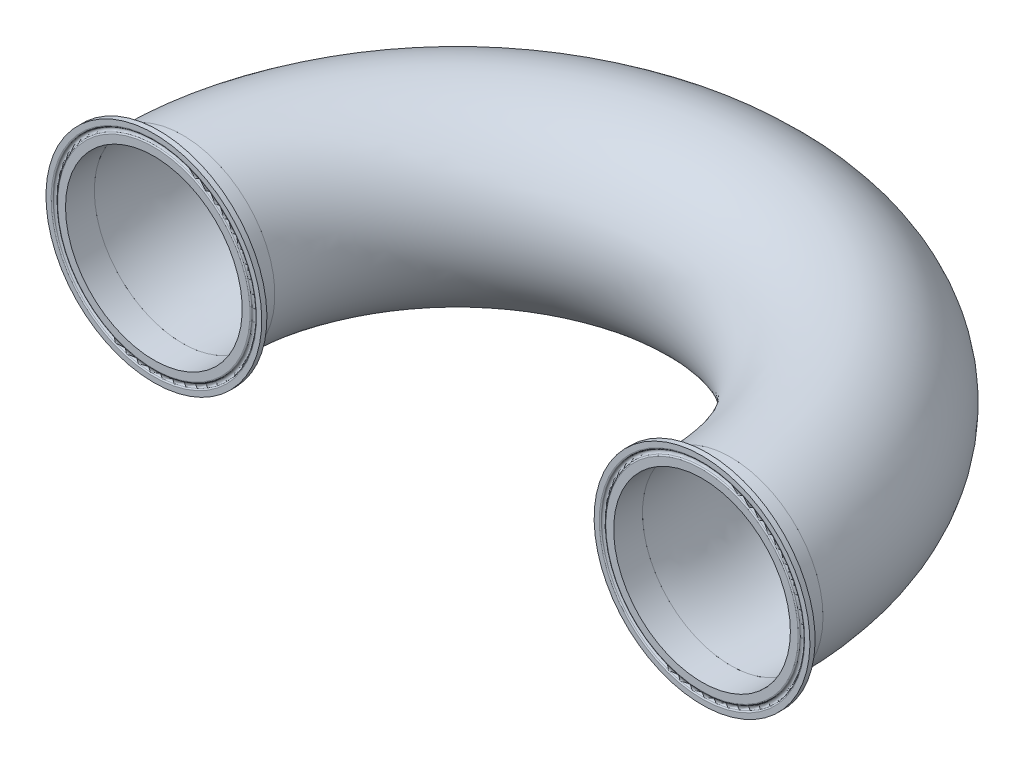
ISO-10303-21;
HEADER;
FILE_DESCRIPTION(('STEP AP214'),'2;1');
FILE_NAME('part.step','',(''),(''),'','','');
FILE_SCHEMA(('AUTOMOTIVE_DESIGN { 1 0 10303 214 1 1 1 1 }'));
ENDSEC;
DATA;
#1=APPLICATION_CONTEXT('core data for automotive mechanical design processes');
#2=APPLICATION_PROTOCOL_DEFINITION('international standard','automotive_design',2000,#1);
#3=PRODUCT_CONTEXT('',#1,'mechanical');
#4=PRODUCT('Part','Part','',(#3));
#5=PRODUCT_RELATED_PRODUCT_CATEGORY('part','',(#4));
#6=PRODUCT_DEFINITION_FORMATION('','',#4);
#7=PRODUCT_DEFINITION_CONTEXT('part definition',#1,'design');
#8=PRODUCT_DEFINITION('design','',#6,#7);
#9=PRODUCT_DEFINITION_SHAPE('','',#8);
#10=(LENGTH_UNIT() NAMED_UNIT(*) SI_UNIT(.MILLI.,.METRE.));
#11=(NAMED_UNIT(*) PLANE_ANGLE_UNIT() SI_UNIT($,.RADIAN.));
#12=(NAMED_UNIT(*) SI_UNIT($,.STERADIAN.) SOLID_ANGLE_UNIT());
#13=UNCERTAINTY_MEASURE_WITH_UNIT(LENGTH_MEASURE(1.E-05),#10,'distance_accuracy_value','');
#14=(GEOMETRIC_REPRESENTATION_CONTEXT(3) GLOBAL_UNCERTAINTY_ASSIGNED_CONTEXT((#13)) GLOBAL_UNIT_ASSIGNED_CONTEXT((#10,
#11,#12)) REPRESENTATION_CONTEXT('',''));
#15=CARTESIAN_POINT('',(0.,0.,0.));
#16=DIRECTION('',(0.,0.,1.));
#17=DIRECTION('',(1.,0.,0.));
#18=AXIS2_PLACEMENT_3D('',#15,#16,#17);
#19=CARTESIAN_POINT('',(271.905177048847,167.407690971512,294.905934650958));
#20=DIRECTION('',(0.,0.,1.));
#21=DIRECTION('',(0.930962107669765,-0.365115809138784,0.));
#22=AXIS2_PLACEMENT_3D('',#19,#20,#21);
#23=TOROIDAL_SURFACE('',#22,56.6185084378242,0.787400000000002);
#24=CARTESIAN_POINT('',(271.905177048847,167.407690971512,295.693334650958));
#25=DIRECTION('',(0.,0.,1.));
#26=DIRECTION('',(0.930962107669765,-0.365115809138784,0.));
#27=AXIS2_PLACEMENT_3D('',#24,#25,#26);
#28=CIRCLE('',#27,56.6185084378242);
#29=CARTESIAN_POINT('',(324.614862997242,146.735378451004,295.693334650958));
#30=VERTEX_POINT('',#29);
#31=EDGE_CURVE('P0_E48',#30,#30,#28,.T.);
#32=ORIENTED_EDGE('',*,*,#31,.T.);
#33=EDGE_LOOP('',(#32));
#34=FACE_BOUND('',#33,.T.);
#35=CARTESIAN_POINT('',(271.905177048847,167.407690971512,295.218875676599));
#36=DIRECTION('',(0.,0.,1.));
#37=DIRECTION('',(0.930962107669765,-0.365115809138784,0.));
#38=AXIS2_PLACEMENT_3D('',#35,#36,#37);
#39=CIRCLE('',#38,55.8959666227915);
#40=CARTESIAN_POINT('',(323.94220394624,146.999189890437,295.218875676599));
#41=VERTEX_POINT('',#40);
#42=EDGE_CURVE('P0_E9',#41,#41,#39,.T.);
#43=ORIENTED_EDGE('',*,*,#42,.F.);
#44=EDGE_LOOP('',(#43));
#45=FACE_BOUND('',#44,.T.);
#46=ADVANCED_FACE('P0_F14',(#34,#45),#23,.T.);
#47=CARTESIAN_POINT('',(271.905177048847,167.407690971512,295.693334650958));
#48=DIRECTION('',(0.,0.,1.));
#49=DIRECTION('',(0.930962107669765,-0.365115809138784,0.));
#50=AXIS2_PLACEMENT_3D('',#47,#48,#49);
#51=TOROIDAL_SURFACE('',#50,54.8005,1.1938);
#52=CARTESIAN_POINT('',(271.905177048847,167.407690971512,295.218875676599));
#53=DIRECTION('',(0.,0.,1.));
#54=DIRECTION('',(0.930962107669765,-0.365115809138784,0.));
#55=AXIS2_PLACEMENT_3D('',#52,#53,#54);
#56=CIRCLE('',#55,53.7050333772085);
#57=CARTESIAN_POINT('',(321.902528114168,147.799134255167,295.218875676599));
#58=VERTEX_POINT('',#57);
#59=EDGE_CURVE('P0_E20',#58,#58,#56,.T.);
#60=ORIENTED_EDGE('',*,*,#59,.F.);
#61=EDGE_LOOP('',(#60));
#62=FACE_BOUND('',#61,.T.);
#63=ORIENTED_EDGE('',*,*,#42,.T.);
#64=EDGE_LOOP('',(#63));
#65=FACE_BOUND('',#64,.T.);
#66=ADVANCED_FACE('P0_F97',(#62,#65),#51,.F.);
#67=CARTESIAN_POINT('',(271.905177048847,167.407690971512,294.905934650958));
#68=DIRECTION('',(0.,0.,1.));
#69=DIRECTION('',(0.930962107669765,-0.365115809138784,0.));
#70=AXIS2_PLACEMENT_3D('',#67,#68,#69);
#71=TOROIDAL_SURFACE('',#70,52.9824915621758,0.787399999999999);
#72=ORIENTED_EDGE('',*,*,#59,.T.);
#73=EDGE_LOOP('',(#72));
#74=FACE_BOUND('',#73,.T.);
#75=CARTESIAN_POINT('',(271.905177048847,167.407690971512,295.693334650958));
#76=DIRECTION('',(0.,0.,1.));
#77=DIRECTION('',(0.930962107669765,-0.365115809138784,0.));
#78=AXIS2_PLACEMENT_3D('',#75,#76,#77);
#79=CIRCLE('',#78,52.9824915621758);
#80=CARTESIAN_POINT('',(321.229869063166,148.062945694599,295.693334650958));
#81=VERTEX_POINT('',#80);
#82=EDGE_CURVE('P0_E24',#81,#81,#79,.T.);
#83=ORIENTED_EDGE('',*,*,#82,.F.);
#84=EDGE_LOOP('',(#83));
#85=FACE_BOUND('',#84,.T.);
#86=ADVANCED_FACE('P0_F93',(#74,#85),#71,.T.);
#87=CARTESIAN_POINT('',(271.905177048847,167.407690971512,295.693334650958));
#88=DIRECTION('',(0.,0.,-1.));
#89=DIRECTION('',(-0.930962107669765,0.365115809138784,0.));
#90=AXIS2_PLACEMENT_3D('',#87,#88,#89);
#91=PLANE('',#90);
#92=CARTESIAN_POINT('',(271.905177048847,167.407690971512,295.693334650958));
#93=DIRECTION('',(0.,0.,1.));
#94=DIRECTION('',(0.930962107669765,-0.365115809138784,0.));
#95=AXIS2_PLACEMENT_3D('',#92,#93,#94);
#96=CIRCLE('',#95,48.6918);
#97=CARTESIAN_POINT('',(317.235397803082,149.629545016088,295.693334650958));
#98=VERTEX_POINT('',#97);
#99=EDGE_CURVE('P0_E28',#98,#98,#96,.T.);
#100=ORIENTED_EDGE('',*,*,#99,.F.);
#101=EDGE_LOOP('',(#100));
#102=FACE_BOUND('',#101,.T.);
#103=ORIENTED_EDGE('',*,*,#82,.T.);
#104=EDGE_LOOP('',(#103));
#105=FACE_BOUND('',#104,.T.);
#106=ADVANCED_FACE('P0_F86',(#102,#105),#91,.F.);
#107=CARTESIAN_POINT('',(271.905177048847,167.407690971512,295.693334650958));
#108=DIRECTION('',(0.,0.,1.));
#109=DIRECTION('',(0.930962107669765,-0.365115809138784,0.));
#110=AXIS2_PLACEMENT_3D('',#107,#108,#109);
#111=CYLINDRICAL_SURFACE('',#110,48.6918);
#112=ORIENTED_EDGE('',*,*,#99,.T.);
#113=EDGE_LOOP('',(#112));
#114=FACE_BOUND('',#113,.T.);
#115=CARTESIAN_POINT('',(271.905177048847,167.407690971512,279.818334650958));
#116=DIRECTION('',(0.,0.,1.));
#117=DIRECTION('',(0.930962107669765,-0.365115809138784,0.));
#118=AXIS2_PLACEMENT_3D('',#115,#116,#117);
#119=CIRCLE('',#118,48.6918);
#120=CARTESIAN_POINT('',(317.235397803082,149.629545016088,279.818334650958));
#121=VERTEX_POINT('',#120);
#122=EDGE_CURVE('P0_E33',#121,#121,#119,.T.);
#123=ORIENTED_EDGE('',*,*,#122,.F.);
#124=EDGE_LOOP('',(#123));
#125=FACE_BOUND('',#124,.T.);
#126=ADVANCED_FACE('P0_F81',(#114,#125),#111,.F.);
#127=CARTESIAN_POINT('',(271.905177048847,167.407690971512,279.818334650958));
#128=DIRECTION('',(0.,0.,1.));
#129=DIRECTION('',(0.930962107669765,-0.365115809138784,0.));
#130=AXIS2_PLACEMENT_3D('',#127,#128,#129);
#131=PLANE('',#130);
#132=CARTESIAN_POINT('',(271.905177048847,167.407690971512,279.818334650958));
#133=DIRECTION('',(0.,0.,1.));
#134=DIRECTION('',(0.930962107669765,-0.365115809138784,0.));
#135=AXIS2_PLACEMENT_3D('',#132,#133,#134);
#136=CIRCLE('',#135,50.8);
#137=CARTESIAN_POINT('',(319.198052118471,148.859807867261,279.818334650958));
#138=VERTEX_POINT('',#137);
#139=EDGE_CURVE('P0_E36',#138,#138,#136,.T.);
#140=ORIENTED_EDGE('',*,*,#139,.F.);
#141=EDGE_LOOP('',(#140));
#142=FACE_BOUND('',#141,.T.);
#143=ORIENTED_EDGE('',*,*,#122,.T.);
#144=EDGE_LOOP('',(#143));
#145=FACE_BOUND('',#144,.T.);
#146=ADVANCED_FACE('P0_F75',(#142,#145),#131,.F.);
#147=CARTESIAN_POINT('',(271.905177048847,167.407690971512,295.693334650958));
#148=DIRECTION('',(0.,0.,1.));
#149=DIRECTION('',(0.930962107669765,-0.365115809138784,0.));
#150=AXIS2_PLACEMENT_3D('',#147,#148,#149);
#151=CYLINDRICAL_SURFACE('',#150,50.8);
#152=CARTESIAN_POINT('',(271.905177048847,167.407690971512,289.696042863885));
#153=DIRECTION('',(0.,0.,1.));
#154=DIRECTION('',(0.930962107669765,-0.365115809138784,0.));
#155=AXIS2_PLACEMENT_3D('',#152,#153,#154);
#156=CIRCLE('',#155,50.8);
#157=CARTESIAN_POINT('',(319.198052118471,148.859807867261,289.696042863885));
#158=VERTEX_POINT('',#157);
#159=EDGE_CURVE('P0_E39',#158,#158,#156,.T.);
#160=ORIENTED_EDGE('',*,*,#159,.F.);
#161=EDGE_LOOP('',(#160));
#162=FACE_BOUND('',#161,.T.);
#163=ORIENTED_EDGE('',*,*,#139,.T.);
#164=EDGE_LOOP('',(#163));
#165=FACE_BOUND('',#164,.T.);
#166=ADVANCED_FACE('P0_F69',(#162,#165),#151,.T.);
#167=CARTESIAN_POINT('',(271.905177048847,167.407690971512,289.696042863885));
#168=DIRECTION('',(0.,0.,1.));
#169=DIRECTION('',(0.930962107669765,-0.365115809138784,0.));
#170=AXIS2_PLACEMENT_3D('',#167,#168,#169);
#171=CONICAL_SURFACE('',#170,50.8,1.22173047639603);
#172=CARTESIAN_POINT('',(271.905177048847,167.407690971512,292.848534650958));
#173=DIRECTION('',(0.,0.,1.));
#174=DIRECTION('',(0.930962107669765,-0.365115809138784,0.));
#175=AXIS2_PLACEMENT_3D('',#172,#173,#174);
#176=CIRCLE('',#175,59.4614);
#177=CARTESIAN_POINT('',(327.261487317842,145.697393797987,292.848534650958));
#178=VERTEX_POINT('',#177);
#179=EDGE_CURVE('P0_E42',#178,#178,#176,.T.);
#180=ORIENTED_EDGE('',*,*,#179,.F.);
#181=EDGE_LOOP('',(#180));
#182=FACE_BOUND('',#181,.T.);
#183=ORIENTED_EDGE('',*,*,#159,.T.);
#184=EDGE_LOOP('',(#183));
#185=FACE_BOUND('',#184,.T.);
#186=ADVANCED_FACE('P0_F63',(#182,#185),#171,.T.);
#187=CARTESIAN_POINT('',(271.905177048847,167.407690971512,295.693334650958));
#188=DIRECTION('',(0.,0.,1.));
#189=DIRECTION('',(0.930962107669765,-0.365115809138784,0.));
#190=AXIS2_PLACEMENT_3D('',#187,#188,#189);
#191=CYLINDRICAL_SURFACE('',#190,59.4614);
#192=CARTESIAN_POINT('',(271.905177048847,167.407690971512,295.693334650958));
#193=DIRECTION('',(0.,0.,1.));
#194=DIRECTION('',(0.930962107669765,-0.365115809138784,0.));
#195=AXIS2_PLACEMENT_3D('',#192,#193,#194);
#196=CIRCLE('',#195,59.4614);
#197=CARTESIAN_POINT('',(327.261487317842,145.697393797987,295.693334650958));
#198=VERTEX_POINT('',#197);
#199=EDGE_CURVE('P0_E45',#198,#198,#196,.T.);
#200=ORIENTED_EDGE('',*,*,#199,.F.);
#201=EDGE_LOOP('',(#200));
#202=FACE_BOUND('',#201,.T.);
#203=ORIENTED_EDGE('',*,*,#179,.T.);
#204=EDGE_LOOP('',(#203));
#205=FACE_BOUND('',#204,.T.);
#206=ADVANCED_FACE('P0_F57',(#202,#205),#191,.T.);
#207=CARTESIAN_POINT('',(271.905177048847,167.407690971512,295.693334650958));
#208=DIRECTION('',(0.,0.,-1.));
#209=DIRECTION('',(-0.930962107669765,0.365115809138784,0.));
#210=AXIS2_PLACEMENT_3D('',#207,#208,#209);
#211=PLANE('',#210);
#212=ORIENTED_EDGE('',*,*,#31,.F.);
#213=EDGE_LOOP('',(#212));
#214=FACE_BOUND('',#213,.T.);
#215=ORIENTED_EDGE('',*,*,#199,.T.);
#216=EDGE_LOOP('',(#215));
#217=FACE_BOUND('',#216,.T.);
#218=ADVANCED_FACE('P0_F54',(#214,#217),#211,.F.);
#219=CLOSED_SHELL('',(#46,#66,#86,#106,#126,#146,#166,#186,#206,#218));
#220=MANIFOLD_SOLID_BREP('P0_B1',#219);
#221=CARTESIAN_POINT('',(-32.8826122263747,167.407690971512,292.177655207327));
#222=DIRECTION('',(0.,0.,1.));
#223=DIRECTION('',(0.90950742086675,-0.415687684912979,0.));
#224=AXIS2_PLACEMENT_3D('',#221,#222,#223);
#225=TOROIDAL_SURFACE('',#224,56.6185084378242,0.787400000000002);
#226=CARTESIAN_POINT('',(-32.8826122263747,167.407690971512,292.965055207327));
#227=DIRECTION('',(0.,0.,1.));
#228=DIRECTION('',(0.90950742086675,-0.415687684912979,0.));
#229=AXIS2_PLACEMENT_3D('',#226,#227,#228);
#230=CIRCLE('',#229,56.6185084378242);
#231=CARTESIAN_POINT('',(18.6123413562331,143.872074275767,292.965055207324));
#232=VERTEX_POINT('',#231);
#233=EDGE_CURVE('P1_E49',#232,#232,#230,.T.);
#234=ORIENTED_EDGE('',*,*,#233,.T.);
#235=EDGE_LOOP('',(#234));
#236=FACE_BOUND('',#235,.T.);
#237=CARTESIAN_POINT('',(-32.8826122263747,167.407690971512,292.490596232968));
#238=DIRECTION('',(0.,0.,1.));
#239=DIRECTION('',(0.90950742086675,-0.415687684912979,0.));
#240=AXIS2_PLACEMENT_3D('',#237,#238,#239);
#241=CIRCLE('',#240,55.8959666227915);
#242=CARTESIAN_POINT('',(17.9551842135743,144.17242601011,292.490596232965));
#243=VERTEX_POINT('',#242);
#244=EDGE_CURVE('P1_E10',#243,#243,#241,.T.);
#245=ORIENTED_EDGE('',*,*,#244,.F.);
#246=EDGE_LOOP('',(#245));
#247=FACE_BOUND('',#246,.T.);
#248=ADVANCED_FACE('P1_F15',(#236,#247),#225,.T.);
#249=CARTESIAN_POINT('',(-32.8826122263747,167.407690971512,292.965055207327));
#250=DIRECTION('',(0.,0.,1.));
#251=DIRECTION('',(0.90950742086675,-0.415687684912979,0.));
#252=AXIS2_PLACEMENT_3D('',#249,#250,#251);
#253=TOROIDAL_SURFACE('',#252,54.8005,1.1938);
#254=CARTESIAN_POINT('',(-32.8826122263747,167.407690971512,292.490596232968));
#255=DIRECTION('',(0.,0.,1.));
#256=DIRECTION('',(0.90950742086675,-0.415687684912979,0.));
#257=AXIS2_PLACEMENT_3D('',#254,#255,#256);
#258=CIRCLE('',#257,53.7050333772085);
#259=CARTESIAN_POINT('',(15.9625141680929,145.083169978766,292.490596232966));
#260=VERTEX_POINT('',#259);
#261=EDGE_CURVE('P1_E21',#260,#260,#258,.T.);
#262=ORIENTED_EDGE('',*,*,#261,.F.);
#263=EDGE_LOOP('',(#262));
#264=FACE_BOUND('',#263,.T.);
#265=ORIENTED_EDGE('',*,*,#244,.T.);
#266=EDGE_LOOP('',(#265));
#267=FACE_BOUND('',#266,.T.);
#268=ADVANCED_FACE('P1_F98',(#264,#267),#253,.F.);
#269=CARTESIAN_POINT('',(-32.8826122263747,167.407690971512,292.177655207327));
#270=DIRECTION('',(0.,0.,1.));
#271=DIRECTION('',(0.90950742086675,-0.415687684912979,0.));
#272=AXIS2_PLACEMENT_3D('',#269,#270,#271);
#273=TOROIDAL_SURFACE('',#272,52.9824915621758,0.787399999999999);
#274=ORIENTED_EDGE('',*,*,#261,.T.);
#275=EDGE_LOOP('',(#274));
#276=FACE_BOUND('',#275,.T.);
#277=CARTESIAN_POINT('',(-32.8826122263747,167.407690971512,292.965055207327));
#278=DIRECTION('',(0.,0.,1.));
#279=DIRECTION('',(0.90950742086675,-0.415687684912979,0.));
#280=AXIS2_PLACEMENT_3D('',#277,#278,#279);
#281=CIRCLE('',#280,52.9824915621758);
#282=CARTESIAN_POINT('',(15.3053570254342,145.383521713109,292.965055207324));
#283=VERTEX_POINT('',#282);
#284=EDGE_CURVE('P1_E25',#283,#283,#281,.T.);
#285=ORIENTED_EDGE('',*,*,#284,.F.);
#286=EDGE_LOOP('',(#285));
#287=FACE_BOUND('',#286,.T.);
#288=ADVANCED_FACE('P1_F94',(#276,#287),#273,.T.);
#289=CARTESIAN_POINT('',(-32.8826122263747,167.407690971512,292.965055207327));
#290=DIRECTION('',(0.,0.,-1.));
#291=DIRECTION('',(-0.90950742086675,0.415687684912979,0.));
#292=AXIS2_PLACEMENT_3D('',#289,#290,#291);
#293=PLANE('',#292);
#294=CARTESIAN_POINT('',(-32.8826122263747,167.407690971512,292.965055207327));
#295=DIRECTION('',(0.,0.,1.));
#296=DIRECTION('',(0.90950742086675,-0.415687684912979,0.));
#297=AXIS2_PLACEMENT_3D('',#294,#295,#296);
#298=CIRCLE('',#297,48.6918);
#299=CARTESIAN_POINT('',(11.4029412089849,147.167109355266,292.965055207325));
#300=VERTEX_POINT('',#299);
#301=EDGE_CURVE('P1_E29',#300,#300,#298,.T.);
#302=ORIENTED_EDGE('',*,*,#301,.F.);
#303=EDGE_LOOP('',(#302));
#304=FACE_BOUND('',#303,.T.);
#305=ORIENTED_EDGE('',*,*,#284,.T.);
#306=EDGE_LOOP('',(#305));
#307=FACE_BOUND('',#306,.T.);
#308=ADVANCED_FACE('P1_F87',(#304,#307),#293,.F.);
#309=CARTESIAN_POINT('',(-32.8826122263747,167.407690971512,292.965055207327));
#310=DIRECTION('',(0.,0.,1.));
#311=DIRECTION('',(0.90950742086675,-0.415687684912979,0.));
#312=AXIS2_PLACEMENT_3D('',#309,#310,#311);
#313=CYLINDRICAL_SURFACE('',#312,48.6918);
#314=ORIENTED_EDGE('',*,*,#301,.T.);
#315=EDGE_LOOP('',(#314));
#316=FACE_BOUND('',#315,.T.);
#317=CARTESIAN_POINT('',(-32.8826122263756,167.407690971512,277.090055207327));
#318=DIRECTION('',(0.,0.,1.));
#319=DIRECTION('',(0.90950742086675,-0.415687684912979,0.));
#320=AXIS2_PLACEMENT_3D('',#317,#318,#319);
#321=CIRCLE('',#320,48.6918);
#322=CARTESIAN_POINT('',(11.402941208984,147.167109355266,277.090055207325));
#323=VERTEX_POINT('',#322);
#324=EDGE_CURVE('P1_E34',#323,#323,#321,.T.);
#325=ORIENTED_EDGE('',*,*,#324,.F.);
#326=EDGE_LOOP('',(#325));
#327=FACE_BOUND('',#326,.T.);
#328=ADVANCED_FACE('P1_F82',(#316,#327),#313,.F.);
#329=CARTESIAN_POINT('',(-32.8826122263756,167.407690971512,277.090055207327));
#330=DIRECTION('',(0.,0.,1.));
#331=DIRECTION('',(0.90950742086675,-0.415687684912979,0.));
#332=AXIS2_PLACEMENT_3D('',#329,#330,#331);
#333=PLANE('',#332);
#334=CARTESIAN_POINT('',(-32.8826122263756,167.407690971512,277.090055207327));
#335=DIRECTION('',(0.,0.,1.));
#336=DIRECTION('',(0.90950742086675,-0.415687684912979,0.));
#337=AXIS2_PLACEMENT_3D('',#334,#335,#336);
#338=CIRCLE('',#337,50.8);
#339=CARTESIAN_POINT('',(13.3203647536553,146.290756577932,277.090055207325));
#340=VERTEX_POINT('',#339);
#341=EDGE_CURVE('P1_E37',#340,#340,#338,.T.);
#342=ORIENTED_EDGE('',*,*,#341,.F.);
#343=EDGE_LOOP('',(#342));
#344=FACE_BOUND('',#343,.T.);
#345=ORIENTED_EDGE('',*,*,#324,.T.);
#346=EDGE_LOOP('',(#345));
#347=FACE_BOUND('',#346,.T.);
#348=ADVANCED_FACE('P1_F76',(#344,#347),#333,.F.);
#349=CARTESIAN_POINT('',(-32.8826122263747,167.407690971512,292.965055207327));
#350=DIRECTION('',(0.,0.,1.));
#351=DIRECTION('',(0.90950742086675,-0.415687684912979,0.));
#352=AXIS2_PLACEMENT_3D('',#349,#350,#351);
#353=CYLINDRICAL_SURFACE('',#352,50.8);
#354=CARTESIAN_POINT('',(-32.882612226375,167.407690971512,286.967763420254));
#355=DIRECTION('',(0.,0.,1.));
#356=DIRECTION('',(0.90950742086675,-0.415687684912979,0.));
#357=AXIS2_PLACEMENT_3D('',#354,#355,#356);
#358=CIRCLE('',#357,50.8);
#359=CARTESIAN_POINT('',(13.3203647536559,146.290756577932,286.967763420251));
#360=VERTEX_POINT('',#359);
#361=EDGE_CURVE('P1_E40',#360,#360,#358,.T.);
#362=ORIENTED_EDGE('',*,*,#361,.F.);
#363=EDGE_LOOP('',(#362));
#364=FACE_BOUND('',#363,.T.);
#365=ORIENTED_EDGE('',*,*,#341,.T.);
#366=EDGE_LOOP('',(#365));
#367=FACE_BOUND('',#366,.T.);
#368=ADVANCED_FACE('P1_F70',(#364,#367),#353,.T.);
#369=CARTESIAN_POINT('',(-32.882612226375,167.407690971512,286.967763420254));
#370=DIRECTION('',(0.,0.,1.));
#371=DIRECTION('',(0.90950742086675,-0.415687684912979,0.));
#372=AXIS2_PLACEMENT_3D('',#369,#370,#371);
#373=CONICAL_SURFACE('',#372,50.8,1.22173047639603);
#374=CARTESIAN_POINT('',(-32.8826122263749,167.407690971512,290.120255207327));
#375=DIRECTION('',(0.,0.,1.));
#376=DIRECTION('',(0.90950742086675,-0.415687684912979,0.));
#377=AXIS2_PLACEMENT_3D('',#374,#375,#376);
#378=CIRCLE('',#377,59.4614);
#379=CARTESIAN_POINT('',(21.1979723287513,142.690319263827,290.120255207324));
#380=VERTEX_POINT('',#379);
#381=EDGE_CURVE('P1_E43',#380,#380,#378,.T.);
#382=ORIENTED_EDGE('',*,*,#381,.F.);
#383=EDGE_LOOP('',(#382));
#384=FACE_BOUND('',#383,.T.);
#385=ORIENTED_EDGE('',*,*,#361,.T.);
#386=EDGE_LOOP('',(#385));
#387=FACE_BOUND('',#386,.T.);
#388=ADVANCED_FACE('P1_F64',(#384,#387),#373,.T.);
#389=CARTESIAN_POINT('',(-32.8826122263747,167.407690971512,292.965055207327));
#390=DIRECTION('',(0.,0.,1.));
#391=DIRECTION('',(0.90950742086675,-0.415687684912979,0.));
#392=AXIS2_PLACEMENT_3D('',#389,#390,#391);
#393=CYLINDRICAL_SURFACE('',#392,59.4614);
#394=CARTESIAN_POINT('',(-32.8826122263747,167.407690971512,292.965055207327));
#395=DIRECTION('',(0.,0.,1.));
#396=DIRECTION('',(0.90950742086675,-0.415687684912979,0.));
#397=AXIS2_PLACEMENT_3D('',#394,#395,#396);
#398=CIRCLE('',#397,59.4614);
#399=CARTESIAN_POINT('',(21.1979723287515,142.690319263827,292.965055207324));
#400=VERTEX_POINT('',#399);
#401=EDGE_CURVE('P1_E46',#400,#400,#398,.T.);
#402=ORIENTED_EDGE('',*,*,#401,.F.);
#403=EDGE_LOOP('',(#402));
#404=FACE_BOUND('',#403,.T.);
#405=ORIENTED_EDGE('',*,*,#381,.T.);
#406=EDGE_LOOP('',(#405));
#407=FACE_BOUND('',#406,.T.);
#408=ADVANCED_FACE('P1_F58',(#404,#407),#393,.T.);
#409=CARTESIAN_POINT('',(-32.8826122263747,167.407690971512,292.965055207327));
#410=DIRECTION('',(0.,0.,-1.));
#411=DIRECTION('',(-0.90950742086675,0.415687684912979,0.));
#412=AXIS2_PLACEMENT_3D('',#409,#410,#411);
#413=PLANE('',#412);
#414=ORIENTED_EDGE('',*,*,#233,.F.);
#415=EDGE_LOOP('',(#414));
#416=FACE_BOUND('',#415,.T.);
#417=ORIENTED_EDGE('',*,*,#401,.T.);
#418=EDGE_LOOP('',(#417));
#419=FACE_BOUND('',#418,.T.);
#420=ADVANCED_FACE('P1_F55',(#416,#419),#413,.F.);
#421=CLOSED_SHELL('',(#248,#268,#288,#308,#328,#348,#368,#388,#408,#420));
#422=MANIFOLD_SOLID_BREP('P1_B1',#421);
#423=CARTESIAN_POINT('',(-32.8826122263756,167.407690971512,277.090055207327));
#424=DIRECTION('',(0.,0.,-1.));
#425=DIRECTION('',(-1.,0.,0.));
#426=AXIS2_PLACEMENT_3D('',#423,#424,#425);
#427=CIRCLE('',#426,50.8);
#428=CARTESIAN_POINT('',(119.511282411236,167.407690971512,278.454194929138));
#429=DIRECTION('',(0.,-1.,0.));
#430=AXIS1_PLACEMENT('',#428,#429);
#431=SURFACE_OF_REVOLUTION('',#427,#430);
#432=CARTESIAN_POINT('',(-83.6826122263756,167.407690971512,277.09005520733));
#433=VERTEX_POINT('',#432);
#434=EDGE_CURVE('P2_E10',#433,#433,#427,.T.);
#435=ORIENTED_EDGE('',*,*,#434,.T.);
#436=EDGE_LOOP('',(#435));
#437=FACE_BOUND('',#436,.T.);
#438=CARTESIAN_POINT('',(271.905177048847,167.407690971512,279.818334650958));
#439=DIRECTION('',(0.,0.,1.));
#440=DIRECTION('',(1.,0.,0.));
#441=AXIS2_PLACEMENT_3D('',#438,#439,#440);
#442=CIRCLE('',#441,50.8);
#443=CARTESIAN_POINT('',(322.705177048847,167.407690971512,279.818334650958));
#444=VERTEX_POINT('',#443);
#445=EDGE_CURVE('P2_E22',#444,#444,#442,.T.);
#446=ORIENTED_EDGE('',*,*,#445,.F.);
#447=EDGE_LOOP('',(#446));
#448=FACE_BOUND('',#447,.T.);
#449=ADVANCED_FACE('P2_F15',(#437,#448),#431,.F.);
#450=CARTESIAN_POINT('',(-32.8826122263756,167.407690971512,277.090055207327));
#451=DIRECTION('',(0.,0.,-1.));
#452=DIRECTION('',(-1.,0.,0.));
#453=AXIS2_PLACEMENT_3D('',#450,#451,#452);
#454=PLANE('',#453);
#455=CARTESIAN_POINT('',(15.8090015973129,167.407690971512,277.090055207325));
#456=CARTESIAN_POINT('',(15.8089925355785,166.03991684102,277.090055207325));
#457=CARTESIAN_POINT('',(15.7513206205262,164.671880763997,277.090055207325));
#458=CARTESIAN_POINT('',(15.5209904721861,161.945301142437,277.090055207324));
#459=CARTESIAN_POINT('',(15.3483019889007,160.58676019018,277.090055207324));
#460=CARTESIAN_POINT('',(14.8888907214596,157.887510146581,277.090055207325));
#461=CARTESIAN_POINT('',(14.6020418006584,156.546822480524,277.090055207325));
#462=CARTESIAN_POINT('',(13.9163735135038,153.894497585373,277.090055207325));
#463=CARTESIAN_POINT('',(13.5175615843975,152.582858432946,277.090055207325));
#464=CARTESIAN_POINT('',(12.6110039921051,149.998446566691,277.090055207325));
#465=CARTESIAN_POINT('',(12.103307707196,148.72565653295,277.090055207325));
#466=CARTESIAN_POINT('',(10.982475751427,146.227357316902,277.090055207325));
#467=CARTESIAN_POINT('',(10.3693384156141,145.001848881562,277.090055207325));
#468=CARTESIAN_POINT('',(9.04215943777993,142.607154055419,277.090055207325));
#469=CARTESIAN_POINT('',(8.3281435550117,141.437953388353,277.090055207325));
#470=CARTESIAN_POINT('',(6.8041675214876,139.163855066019,277.090055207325));
#471=CARTESIAN_POINT('',(5.99420774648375,138.058957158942,277.090055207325));
#472=CARTESIAN_POINT('',(4.2840114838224,135.92120402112,277.090055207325));
#473=CARTESIAN_POINT('',(3.38376582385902,134.888356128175,277.090055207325));
#474=CARTESIAN_POINT('',(1.49946544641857,132.902168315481,277.090055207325));
#475=CARTESIAN_POINT('',(0.515410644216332,131.948828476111,277.090055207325));
#476=CARTESIAN_POINT('',(-1.52955131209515,130.128400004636,277.090055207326));
#477=CARTESIAN_POINT('',(-2.59046145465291,129.261314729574,277.090055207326));
#478=CARTESIAN_POINT('',(-4.78155724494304,127.619602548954,277.090055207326));
#479=CARTESIAN_POINT('',(-5.91174287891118,126.844975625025,277.090055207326));
#480=CARTESIAN_POINT('',(-8.23332684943,125.393704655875,277.090055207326));
#481=CARTESIAN_POINT('',(-9.42472372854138,124.717058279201,277.090055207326));
#482=CARTESIAN_POINT('',(-11.8602847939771,123.466537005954,277.090055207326));
#483=CARTESIAN_POINT('',(-13.1044489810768,122.892662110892,277.090055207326));
#484=CARTESIAN_POINT('',(-15.6366967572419,121.851764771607,277.090055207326));
#485=CARTESIAN_POINT('',(-16.9247802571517,121.38474211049,277.090055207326));
#486=CARTESIAN_POINT('',(-19.535711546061,120.560867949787,277.090055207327));
#487=CARTESIAN_POINT('',(-20.8585593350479,120.20401645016,277.090055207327));
#488=CARTESIAN_POINT('',(-23.5296162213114,119.603021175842,277.090055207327));
#489=CARTESIAN_POINT('',(-24.8778253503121,119.358877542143,277.090055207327));
#490=CARTESIAN_POINT('',(-27.5900183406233,118.985034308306,277.090055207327));
#491=CARTESIAN_POINT('',(-28.954002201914,118.855334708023,277.090055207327));
#492=CARTESIAN_POINT('',(-31.688045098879,118.711301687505,277.090055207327));
#493=CARTESIAN_POINT('',(-33.0581041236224,118.696968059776,277.090055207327));
#494=CARTESIAN_POINT('',(-35.7945595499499,118.783768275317,277.090055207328));
#495=CARTESIAN_POINT('',(-37.1609559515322,118.884902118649,277.090055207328));
#496=CARTESIAN_POINT('',(-39.8803750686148,119.201918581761,277.090055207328));
#497=CARTESIAN_POINT('',(-41.2333977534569,119.41780146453,277.090055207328));
#498=CARTESIAN_POINT('',(-43.9164471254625,119.962781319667,277.090055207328));
#499=CARTESIAN_POINT('',(-45.2464738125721,120.291878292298,277.090055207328));
#500=CARTESIAN_POINT('',(-47.874076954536,121.060947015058,277.090055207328));
#501=CARTESIAN_POINT('',(-49.1716533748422,121.500918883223,277.090055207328));
#502=CARTESIAN_POINT('',(-51.725129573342,122.488609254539,277.090055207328));
#503=CARTESIAN_POINT('',(-52.9810293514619,123.03632775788,277.090055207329));
#504=CARTESIAN_POINT('',(-55.4422257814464,124.235618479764,277.090055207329));
#505=CARTESIAN_POINT('',(-56.6475223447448,124.887190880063,277.090055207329));
#506=CARTESIAN_POINT('',(-58.9989411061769,126.289556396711,277.090055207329));
#507=CARTESIAN_POINT('',(-60.145063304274,127.040349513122,277.090055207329));
#508=CARTESIAN_POINT('',(-62.3699846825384,128.635818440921,277.090055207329));
#509=CARTESIAN_POINT('',(-63.4487838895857,129.480494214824,277.090055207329));
#510=CARTESIAN_POINT('',(-65.5313902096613,131.257723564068,277.090055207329));
#511=CARTESIAN_POINT('',(-66.5351973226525,132.190277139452,277.090055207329));
#512=CARTESIAN_POINT('',(-68.4606844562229,134.136633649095,277.090055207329));
#513=CARTESIAN_POINT('',(-69.3823643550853,135.150436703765,277.09005520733));
#514=CARTESIAN_POINT('',(-71.1370428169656,137.252083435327,277.09005520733));
#515=CARTESIAN_POINT('',(-71.9700413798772,138.339927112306,277.09005520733));
#516=CARTESIAN_POINT('',(-73.5414351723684,140.581921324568,277.09005520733));
#517=CARTESIAN_POINT('',(-74.2798303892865,141.736071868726,277.09005520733));
#518=CARTESIAN_POINT('',(-75.6567678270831,144.10247436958,277.09005520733));
#519=CARTESIAN_POINT('',(-76.2953100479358,145.314726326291,277.09005520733));
#520=CARTESIAN_POINT('',(-77.4680022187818,147.788714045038,277.09005520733));
#521=CARTESIAN_POINT('',(-78.002152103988,149.050449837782,277.09005520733));
#522=CARTESIAN_POINT('',(-78.9622616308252,151.614434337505,277.09005520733));
#523=CARTESIAN_POINT('',(-79.3882212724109,152.916683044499,277.09005520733));
#524=CARTESIAN_POINT('',(-80.1289219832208,155.552435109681,277.09005520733));
#525=CARTESIAN_POINT('',(-80.4436630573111,156.8859384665,277.09005520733));
#526=CARTESIAN_POINT('',(-80.9596890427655,159.574719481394,277.09005520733));
#527=CARTESIAN_POINT('',(-81.1609739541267,160.929997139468,277.09005520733));
#528=CARTESIAN_POINT('',(-81.4486566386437,163.652691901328,277.09005520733));
#529=CARTESIAN_POINT('',(-81.5350543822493,165.020109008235,277.09005520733));
#530=CARTESIAN_POINT('',(-81.5923483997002,167.757360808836,277.09005520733));
#531=CARTESIAN_POINT('',(-81.5632446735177,169.127195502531,277.09005520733));
#532=CARTESIAN_POINT('',(-81.3897426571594,171.859543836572,277.09005520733));
#533=CARTESIAN_POINT('',(-81.2453443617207,173.222057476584,277.09005520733));
#534=CARTESIAN_POINT('',(-80.8422797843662,175.930076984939,277.09005520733));
#535=CARTESIAN_POINT('',(-80.5836135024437,177.275582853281,277.09005520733));
#536=CARTESIAN_POINT('',(-79.9538518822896,179.940021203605,277.09005520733));
#537=CARTESIAN_POINT('',(-79.5827565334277,181.258953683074,277.09005520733));
#538=CARTESIAN_POINT('',(-78.7307750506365,183.860868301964,277.09005520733));
#539=CARTESIAN_POINT('',(-78.2498889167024,185.143850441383,277.09005520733));
#540=CARTESIAN_POINT('',(-77.1817447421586,187.66474297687,277.09005520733));
#541=CARTESIAN_POINT('',(-76.5944867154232,188.902653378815,277.09005520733));
#542=CARTESIAN_POINT('',(-75.3177737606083,191.324601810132,277.09005520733));
#543=CARTESIAN_POINT('',(-74.6283188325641,192.508639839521,277.09005520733));
#544=CARTESIAN_POINT('',(-73.1521138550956,194.814425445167,277.09005520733));
#545=CARTESIAN_POINT('',(-72.3653638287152,195.936173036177,277.09005520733));
#546=CARTESIAN_POINT('',(-70.7001618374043,198.109403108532,277.09005520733));
#547=CARTESIAN_POINT('',(-69.8217098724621,199.160885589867,277.09005520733));
#548=CARTESIAN_POINT('',(-67.9793488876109,201.186110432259,277.090055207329));
#549=CARTESIAN_POINT('',(-67.0154398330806,202.159852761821,277.090055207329));
#550=CARTESIAN_POINT('',(-65.0090177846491,204.022674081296,277.090055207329));
#551=CARTESIAN_POINT('',(-63.9665047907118,204.91175307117,277.090055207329));
#552=CARTESIAN_POINT('',(-61.8102865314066,206.598926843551,277.090055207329));
#553=CARTESIAN_POINT('',(-60.6965812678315,207.397021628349,277.090055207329));
#554=CARTESIAN_POINT('',(-58.4058962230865,208.896553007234,277.090055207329));
#555=CARTESIAN_POINT('',(-57.2289164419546,209.597989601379,277.090055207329));
#556=CARTESIAN_POINT('',(-54.8200512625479,210.899217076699,277.090055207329));
#557=CARTESIAN_POINT('',(-53.5881659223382,211.499008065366,277.090055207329));
#558=CARTESIAN_POINT('',(-51.0782464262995,212.592681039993,277.090055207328));
#559=CARTESIAN_POINT('',(-49.8002122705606,213.086563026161,277.090055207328));
#560=CARTESIAN_POINT('',(-47.2070827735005,213.964906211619,277.090055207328));
#561=CARTESIAN_POINT('',(-45.8919874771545,214.34936754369,277.090055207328));
#562=CARTESIAN_POINT('',(-43.2340837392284,215.006136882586,277.090055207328));
#563=CARTESIAN_POINT('',(-41.8912752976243,215.278444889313,277.090055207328));
#564=CARTESIAN_POINT('',(-39.1874893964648,215.708971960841,277.090055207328));
#565=CARTESIAN_POINT('',(-37.8265119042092,215.867190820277,277.090055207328));
#566=CARTESIAN_POINT('',(-35.0960660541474,216.068413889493,277.090055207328));
#567=CARTESIAN_POINT('',(-33.7265976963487,216.111418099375,277.090055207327));
#568=CARTESIAN_POINT('',(-30.9889110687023,216.081906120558,277.090055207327));
#569=CARTESIAN_POINT('',(-29.6206927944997,216.009390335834,277.090055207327));
#570=CARTESIAN_POINT('',(-26.8952287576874,215.749354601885,277.090055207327));
#571=CARTESIAN_POINT('',(-25.5379829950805,215.561834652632,277.090055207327));
#572=CARTESIAN_POINT('',(-22.8441105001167,215.073123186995,277.090055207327));
#573=CARTESIAN_POINT('',(-21.5074838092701,214.771931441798,277.090055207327));
#574=CARTESIAN_POINT('',(-18.8643549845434,214.058017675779,277.090055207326));
#575=CARTESIAN_POINT('',(-17.5578528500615,213.645295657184,277.090055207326));
#576=CARTESIAN_POINT('',(-14.984240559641,212.711247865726,277.090055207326));
#577=CARTESIAN_POINT('',(-13.7171310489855,212.189920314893,277.090055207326));
#578=CARTESIAN_POINT('',(-11.2313349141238,211.042371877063,277.090055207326));
#579=CARTESIAN_POINT('',(-10.0126482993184,210.416150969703,277.090055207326));
#580=CARTESIAN_POINT('',(-7.63240912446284,209.063294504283,277.090055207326));
#581=CARTESIAN_POINT('',(-6.47085434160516,208.336662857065,277.090055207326));
#582=CARTESIAN_POINT('',(-4.21308676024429,206.788132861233,277.090055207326));
#583=CARTESIAN_POINT('',(-3.11687389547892,205.966234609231,277.090055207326));
#584=CARTESIAN_POINT('',(-0.997696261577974,204.233107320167,277.090055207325));
#585=CARTESIAN_POINT('',(0.0252763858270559,203.321887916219,277.090055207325));
#586=CARTESIAN_POINT('',(1.99083661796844,201.416517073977,277.090055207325));
#587=CARTESIAN_POINT('',(2.93342388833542,200.422365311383,277.090055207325));
#588=CARTESIAN_POINT('',(4.73173880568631,198.357935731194,277.090055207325));
#589=CARTESIAN_POINT('',(5.58744424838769,197.287638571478,277.090055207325));
#590=CARTESIAN_POINT('',(7.20562384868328,195.078770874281,277.090055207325));
#591=CARTESIAN_POINT('',(7.96809947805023,193.940201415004,277.090055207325));
#592=CARTESIAN_POINT('',(9.39473772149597,191.602341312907,277.090055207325));
#593=CARTESIAN_POINT('',(10.0588554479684,190.403023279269,277.090055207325));
#594=CARTESIAN_POINT('',(11.2836792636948,187.952585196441,277.090055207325));
#595=CARTESIAN_POINT('',(11.8443784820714,186.701461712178,277.090055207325));
#596=CARTESIAN_POINT('',(12.8577511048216,184.157850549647,277.090055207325));
#597=CARTESIAN_POINT('',(13.3105433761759,182.86541018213,277.090055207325));
#598=CARTESIAN_POINT('',(14.1056080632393,180.247198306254,277.090055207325));
#599=CARTESIAN_POINT('',(14.4479095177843,178.921435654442,277.090055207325));
#600=CARTESIAN_POINT('',(14.9123223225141,176.748403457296,277.090055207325));
#601=CARTESIAN_POINT('',(15.0688551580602,175.908326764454,277.090055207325));
#602=CARTESIAN_POINT('',(15.3375327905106,174.220991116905,277.090055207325));
#603=CARTESIAN_POINT('',(15.4496743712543,173.373731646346,277.090055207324));
#604=CARTESIAN_POINT('',(15.6292196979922,171.674485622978,277.090055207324));
#605=CARTESIAN_POINT('',(15.6966234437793,170.822499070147,277.090055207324));
#606=CARTESIAN_POINT('',(15.7865155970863,169.116272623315,277.090055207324));
#607=CARTESIAN_POINT('',(15.8090072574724,168.262032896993,277.090055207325));
#608=CARTESIAN_POINT('',(15.8090015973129,167.407690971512,277.090055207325));
#609=B_SPLINE_CURVE_WITH_KNOTS('',3,(#455,#456,#457,#458,#459,#460,#461,#462,#463,#464,#465,
#466,#467,#468,#469,#470,#471,#472,#473,#474,#475,#476,#477,#478,#479,#480,#481,#482,#483,#484,
#485,#486,#487,#488,#489,#490,#491,#492,#493,#494,#495,#496,#497,#498,#499,#500,#501,#502,#503,
#504,#505,#506,#507,#508,#509,#510,#511,#512,#513,#514,#515,#516,#517,#518,#519,#520,#521,#522,
#523,#524,#525,#526,#527,#528,#529,#530,#531,#532,#533,#534,#535,#536,#537,#538,#539,#540,#541,
#542,#543,#544,#545,#546,#547,#548,#549,#550,#551,#552,#553,#554,#555,#556,#557,#558,#559,#560,
#561,#562,#563,#564,#565,#566,#567,#568,#569,#570,#571,#572,#573,#574,#575,#576,#577,#578,#579,
#580,#581,#582,#583,#584,#585,#586,#587,#588,#589,#590,#591,#592,#593,#594,#595,#596,#597,#598,
#599,#600,#601,#602,#603,#604,#605,#606,#607,#608),.UNSPECIFIED.,.T.,.F.,(4,2,2,2,2,2,2,2,2,2,2,
2,2,2,2,2,2,2,2,2,2,2,2,2,2,2,2,2,2,2,2,2,2,2,2,2,2,2,2,2,2,2,2,2,2,2,2,2,2,2,2,2,2,2,2,2,2,2,2,
2,2,2,2,2,2,2,2,2,2,2,2,2,2,2,2,2,4),(0.,4.10256278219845,8.20620498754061,12.314393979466,
16.4223101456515,20.5283673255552,24.6344893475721,28.7395647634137,32.8446241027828,
36.9501009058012,41.0555818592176,45.1612225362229,49.2668623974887,53.3724045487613,
57.4779467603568,61.5834806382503,65.6890145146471,69.7945535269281,73.9000925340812,
78.0056241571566,82.1111557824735,86.2166968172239,90.3222378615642,94.4277832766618,
98.5333286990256,102.638881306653,106.744433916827,110.849984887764,114.955535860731,
119.061092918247,123.166649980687,127.2722075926,131.377765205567,135.483325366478,
139.588885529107,143.694445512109,147.800005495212,151.905566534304,156.011127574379,
160.116688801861,164.222250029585,168.327811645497,172.433373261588,176.538934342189,
180.64449542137,184.750055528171,188.855615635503,192.961177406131,197.066739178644,
201.172300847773,205.277862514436,209.38341983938,213.488977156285,217.594529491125,
221.700081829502,225.805641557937,229.911201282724,234.016746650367,238.122292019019,
242.227845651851,246.333399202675,250.439019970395,254.544641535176,258.650103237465,
262.755560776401,266.860576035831,270.965607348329,275.07168515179,279.177698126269,
283.285579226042,287.393733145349,291.49734051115,295.599868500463,298.162419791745,
300.725156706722,303.287893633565,305.85044494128),.UNSPECIFIED.);
#610=CARTESIAN_POINT('',(15.8090015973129,167.407690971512,277.090055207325));
#611=VERTEX_POINT('',#610);
#612=EDGE_CURVE('P2_E26',#611,#611,#609,.T.);
#613=ORIENTED_EDGE('',*,*,#612,.T.);
#614=EDGE_LOOP('',(#613));
#615=FACE_BOUND('',#614,.T.);
#616=ORIENTED_EDGE('',*,*,#434,.F.);
#617=EDGE_LOOP('',(#616));
#618=FACE_BOUND('',#617,.T.);
#619=ADVANCED_FACE('P2_F53',(#615,#618),#454,.F.);
#620=CARTESIAN_POINT('',(271.905177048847,167.407690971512,279.818334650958));
#621=DIRECTION('',(0.,0.,1.));
#622=DIRECTION('',(1.,0.,0.));
#623=AXIS2_PLACEMENT_3D('',#620,#621,#622);
#624=PLANE('',#623);
#625=CARTESIAN_POINT('',(223.213563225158,167.407690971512,279.818334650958));
#626=CARTESIAN_POINT('',(223.213572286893,166.03991684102,279.818334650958));
#627=CARTESIAN_POINT('',(223.271244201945,164.671880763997,279.818334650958));
#628=CARTESIAN_POINT('',(223.501574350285,161.945301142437,279.818334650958));
#629=CARTESIAN_POINT('',(223.674262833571,160.58676019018,279.818334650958));
#630=CARTESIAN_POINT('',(224.133674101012,157.887510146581,279.818334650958));
#631=CARTESIAN_POINT('',(224.420523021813,156.546822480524,279.818334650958));
#632=CARTESIAN_POINT('',(225.106191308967,153.894497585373,279.818334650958));
#633=CARTESIAN_POINT('',(225.505003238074,152.582858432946,279.818334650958));
#634=CARTESIAN_POINT('',(226.411560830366,149.998446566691,279.818334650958));
#635=CARTESIAN_POINT('',(226.919257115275,148.72565653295,279.818334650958));
#636=CARTESIAN_POINT('',(228.040089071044,146.227357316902,279.818334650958));
#637=CARTESIAN_POINT('',(228.653226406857,145.001848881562,279.818334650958));
#638=CARTESIAN_POINT('',(229.980405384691,142.607154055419,279.818334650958));
#639=CARTESIAN_POINT('',(230.69442126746,141.437953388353,279.818334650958));
#640=CARTESIAN_POINT('',(232.218397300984,139.163855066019,279.818334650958));
#641=CARTESIAN_POINT('',(233.028357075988,138.058957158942,279.818334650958));
#642=CARTESIAN_POINT('',(234.738553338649,135.92120402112,279.818334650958));
#643=CARTESIAN_POINT('',(235.638798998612,134.888356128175,279.818334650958));
#644=CARTESIAN_POINT('',(237.523099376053,132.902168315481,279.818334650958));
#645=CARTESIAN_POINT('',(238.507154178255,131.948828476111,279.818334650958));
#646=CARTESIAN_POINT('',(240.552116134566,130.128400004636,279.818334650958));
#647=CARTESIAN_POINT('',(241.613026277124,129.261314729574,279.818334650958));
#648=CARTESIAN_POINT('',(243.804122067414,127.619602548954,279.818334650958));
#649=CARTESIAN_POINT('',(244.934307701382,126.844975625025,279.818334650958));
#650=CARTESIAN_POINT('',(247.255891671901,125.393704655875,279.818334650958));
#651=CARTESIAN_POINT('',(248.447288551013,124.717058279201,279.818334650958));
#652=CARTESIAN_POINT('',(250.882849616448,123.466537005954,279.818334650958));
#653=CARTESIAN_POINT('',(252.127013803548,122.892662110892,279.818334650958));
#654=CARTESIAN_POINT('',(254.659261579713,121.851764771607,279.818334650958));
#655=CARTESIAN_POINT('',(255.947345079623,121.38474211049,279.818334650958));
#656=CARTESIAN_POINT('',(258.558276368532,120.560867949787,279.818334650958));
#657=CARTESIAN_POINT('',(259.881124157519,120.20401645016,279.818334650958));
#658=CARTESIAN_POINT('',(262.552181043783,119.603021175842,279.818334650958));
#659=CARTESIAN_POINT('',(263.900390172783,119.358877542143,279.818334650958));
#660=CARTESIAN_POINT('',(266.612583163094,118.985034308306,279.818334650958));
#661=CARTESIAN_POINT('',(267.976567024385,118.855334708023,279.818334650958));
#662=CARTESIAN_POINT('',(270.71060992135,118.711301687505,279.818334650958));
#663=CARTESIAN_POINT('',(272.080668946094,118.696968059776,279.818334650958));
#664=CARTESIAN_POINT('',(274.817124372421,118.783768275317,279.818334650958));
#665=CARTESIAN_POINT('',(276.183520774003,118.884902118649,279.818334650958));
#666=CARTESIAN_POINT('',(278.902939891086,119.201918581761,279.818334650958));
#667=CARTESIAN_POINT('',(280.255962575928,119.41780146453,279.818334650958));
#668=CARTESIAN_POINT('',(282.939011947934,119.962781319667,279.818334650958));
#669=CARTESIAN_POINT('',(284.269038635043,120.291878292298,279.818334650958));
#670=CARTESIAN_POINT('',(286.896641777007,121.060947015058,279.818334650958));
#671=CARTESIAN_POINT('',(288.194218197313,121.500918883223,279.818334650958));
#672=CARTESIAN_POINT('',(290.747694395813,122.488609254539,279.818334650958));
#673=CARTESIAN_POINT('',(292.003594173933,123.03632775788,279.818334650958));
#674=CARTESIAN_POINT('',(294.464790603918,124.235618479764,279.818334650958));
#675=CARTESIAN_POINT('',(295.670087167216,124.887190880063,279.818334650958));
#676=CARTESIAN_POINT('',(298.021505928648,126.289556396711,279.818334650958));
#677=CARTESIAN_POINT('',(299.167628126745,127.040349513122,279.818334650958));
#678=CARTESIAN_POINT('',(301.39254950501,128.635818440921,279.818334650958));
#679=CARTESIAN_POINT('',(302.471348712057,129.480494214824,279.818334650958));
#680=CARTESIAN_POINT('',(304.553955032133,131.257723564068,279.818334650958));
#681=CARTESIAN_POINT('',(305.557762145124,132.190277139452,279.818334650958));
#682=CARTESIAN_POINT('',(307.483249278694,134.136633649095,279.818334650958));
#683=CARTESIAN_POINT('',(308.404929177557,135.150436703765,279.818334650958));
#684=CARTESIAN_POINT('',(310.159607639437,137.252083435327,279.818334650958));
#685=CARTESIAN_POINT('',(310.992606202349,138.339927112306,279.818334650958));
#686=CARTESIAN_POINT('',(312.56399999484,140.581921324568,279.818334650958));
#687=CARTESIAN_POINT('',(313.302395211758,141.736071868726,279.818334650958));
#688=CARTESIAN_POINT('',(314.679332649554,144.10247436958,279.818334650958));
#689=CARTESIAN_POINT('',(315.317874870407,145.314726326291,279.818334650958));
#690=CARTESIAN_POINT('',(316.490567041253,147.788714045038,279.818334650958));
#691=CARTESIAN_POINT('',(317.024716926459,149.050449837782,279.818334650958));
#692=CARTESIAN_POINT('',(317.984826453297,151.614434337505,279.818334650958));
#693=CARTESIAN_POINT('',(318.410786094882,152.916683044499,279.818334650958));
#694=CARTESIAN_POINT('',(319.151486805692,155.552435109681,279.818334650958));
#695=CARTESIAN_POINT('',(319.466227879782,156.8859384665,279.818334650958));
#696=CARTESIAN_POINT('',(319.982253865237,159.574719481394,279.818334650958));
#697=CARTESIAN_POINT('',(320.183538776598,160.929997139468,279.818334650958));
#698=CARTESIAN_POINT('',(320.471221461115,163.652691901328,279.818334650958));
#699=CARTESIAN_POINT('',(320.557619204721,165.020109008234,279.818334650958));
#700=CARTESIAN_POINT('',(320.614913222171,167.757360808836,279.818334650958));
#701=CARTESIAN_POINT('',(320.585809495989,169.127195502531,279.818334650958));
#702=CARTESIAN_POINT('',(320.412307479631,171.859543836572,279.818334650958));
#703=CARTESIAN_POINT('',(320.267909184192,173.222057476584,279.818334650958));
#704=CARTESIAN_POINT('',(319.864844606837,175.930076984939,279.818334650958));
#705=CARTESIAN_POINT('',(319.606178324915,177.275582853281,279.818334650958));
#706=CARTESIAN_POINT('',(318.976416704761,179.940021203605,279.818334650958));
#707=CARTESIAN_POINT('',(318.605321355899,181.258953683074,279.818334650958));
#708=CARTESIAN_POINT('',(317.753339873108,183.860868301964,279.818334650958));
#709=CARTESIAN_POINT('',(317.272453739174,185.143850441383,279.818334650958));
#710=CARTESIAN_POINT('',(316.20430956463,187.66474297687,279.818334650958));
#711=CARTESIAN_POINT('',(315.617051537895,188.902653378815,279.818334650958));
#712=CARTESIAN_POINT('',(314.34033858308,191.324601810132,279.818334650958));
#713=CARTESIAN_POINT('',(313.650883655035,192.508639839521,279.818334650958));
#714=CARTESIAN_POINT('',(312.174678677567,194.814425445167,279.818334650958));
#715=CARTESIAN_POINT('',(311.387928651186,195.936173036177,279.818334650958));
#716=CARTESIAN_POINT('',(309.722726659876,198.109403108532,279.818334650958));
#717=CARTESIAN_POINT('',(308.844274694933,199.160885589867,279.818334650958));
#718=CARTESIAN_POINT('',(307.001913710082,201.186110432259,279.818334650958));
#719=CARTESIAN_POINT('',(306.038004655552,202.159852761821,279.818334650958));
#720=CARTESIAN_POINT('',(304.03158260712,204.022674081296,279.818334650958));
#721=CARTESIAN_POINT('',(302.989069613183,204.91175307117,279.818334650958));
#722=CARTESIAN_POINT('',(300.832851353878,206.598926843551,279.818334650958));
#723=CARTESIAN_POINT('',(299.719146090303,207.397021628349,279.818334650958));
#724=CARTESIAN_POINT('',(297.428461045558,208.896553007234,279.818334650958));
#725=CARTESIAN_POINT('',(296.251481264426,209.597989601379,279.818334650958));
#726=CARTESIAN_POINT('',(293.842616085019,210.899217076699,279.818334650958));
#727=CARTESIAN_POINT('',(292.61073074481,211.499008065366,279.818334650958));
#728=CARTESIAN_POINT('',(290.100811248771,212.592681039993,279.818334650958));
#729=CARTESIAN_POINT('',(288.822777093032,213.086563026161,279.818334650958));
#730=CARTESIAN_POINT('',(286.229647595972,213.964906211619,279.818334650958));
#731=CARTESIAN_POINT('',(284.914552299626,214.34936754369,279.818334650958));
#732=CARTESIAN_POINT('',(282.2566485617,215.006136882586,279.818334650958));
#733=CARTESIAN_POINT('',(280.913840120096,215.278444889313,279.818334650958));
#734=CARTESIAN_POINT('',(278.210054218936,215.708971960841,279.818334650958));
#735=CARTESIAN_POINT('',(276.849076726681,215.867190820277,279.818334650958));
#736=CARTESIAN_POINT('',(274.118630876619,216.068413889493,279.818334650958));
#737=CARTESIAN_POINT('',(272.74916251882,216.111418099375,279.818334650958));
#738=CARTESIAN_POINT('',(270.011475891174,216.081906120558,279.818334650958));
#739=CARTESIAN_POINT('',(268.643257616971,216.009390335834,279.818334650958));
#740=CARTESIAN_POINT('',(265.917793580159,215.749354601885,279.818334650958));
#741=CARTESIAN_POINT('',(264.560547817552,215.561834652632,279.818334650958));
#742=CARTESIAN_POINT('',(261.866675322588,215.073123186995,279.818334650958));
#743=CARTESIAN_POINT('',(260.530048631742,214.771931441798,279.818334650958));
#744=CARTESIAN_POINT('',(257.886919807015,214.058017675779,279.818334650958));
#745=CARTESIAN_POINT('',(256.580417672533,213.645295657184,279.818334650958));
#746=CARTESIAN_POINT('',(254.006805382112,212.711247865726,279.818334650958));
#747=CARTESIAN_POINT('',(252.739695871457,212.189920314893,279.818334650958));
#748=CARTESIAN_POINT('',(250.253899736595,211.042371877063,279.818334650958));
#749=CARTESIAN_POINT('',(249.03521312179,210.416150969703,279.818334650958));
#750=CARTESIAN_POINT('',(246.654973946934,209.063294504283,279.818334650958));
#751=CARTESIAN_POINT('',(245.493419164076,208.336662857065,279.818334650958));
#752=CARTESIAN_POINT('',(243.235651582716,206.788132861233,279.818334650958));
#753=CARTESIAN_POINT('',(242.13943871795,205.966234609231,279.818334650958));
#754=CARTESIAN_POINT('',(240.020261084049,204.233107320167,279.818334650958));
#755=CARTESIAN_POINT('',(238.997288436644,203.321887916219,279.818334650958));
#756=CARTESIAN_POINT('',(237.031728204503,201.416517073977,279.818334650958));
#757=CARTESIAN_POINT('',(236.089140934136,200.422365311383,279.818334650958));
#758=CARTESIAN_POINT('',(234.290826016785,198.357935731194,279.818334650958));
#759=CARTESIAN_POINT('',(233.435120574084,197.287638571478,279.818334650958));
#760=CARTESIAN_POINT('',(231.816940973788,195.078770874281,279.818334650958));
#761=CARTESIAN_POINT('',(231.054465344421,193.940201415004,279.818334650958));
#762=CARTESIAN_POINT('',(229.627827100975,191.602341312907,279.818334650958));
#763=CARTESIAN_POINT('',(228.963709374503,190.403023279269,279.818334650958));
#764=CARTESIAN_POINT('',(227.738885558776,187.952585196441,279.818334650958));
#765=CARTESIAN_POINT('',(227.1781863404,186.701461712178,279.818334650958));
#766=CARTESIAN_POINT('',(226.16481371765,184.157850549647,279.818334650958));
#767=CARTESIAN_POINT('',(225.712021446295,182.86541018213,279.818334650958));
#768=CARTESIAN_POINT('',(224.916956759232,180.247198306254,279.818334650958));
#769=CARTESIAN_POINT('',(224.574655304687,178.921435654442,279.818334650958));
#770=CARTESIAN_POINT('',(224.110242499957,176.748403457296,279.818334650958));
#771=CARTESIAN_POINT('',(223.953709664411,175.908326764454,279.818334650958));
#772=CARTESIAN_POINT('',(223.685032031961,174.220991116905,279.818334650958));
#773=CARTESIAN_POINT('',(223.572890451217,173.373731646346,279.818334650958));
#774=CARTESIAN_POINT('',(223.393345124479,171.674485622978,279.818334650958));
#775=CARTESIAN_POINT('',(223.325941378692,170.822499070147,279.818334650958));
#776=CARTESIAN_POINT('',(223.236049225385,169.116272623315,279.818334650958));
#777=CARTESIAN_POINT('',(223.213557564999,168.262032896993,279.818334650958));
#778=CARTESIAN_POINT('',(223.213563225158,167.407690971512,279.818334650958));
#779=B_SPLINE_CURVE_WITH_KNOTS('',3,(#625,#626,#627,#628,#629,#630,#631,#632,#633,#634,#635,
#636,#637,#638,#639,#640,#641,#642,#643,#644,#645,#646,#647,#648,#649,#650,#651,#652,#653,#654,
#655,#656,#657,#658,#659,#660,#661,#662,#663,#664,#665,#666,#667,#668,#669,#670,#671,#672,#673,
#674,#675,#676,#677,#678,#679,#680,#681,#682,#683,#684,#685,#686,#687,#688,#689,#690,#691,#692,
#693,#694,#695,#696,#697,#698,#699,#700,#701,#702,#703,#704,#705,#706,#707,#708,#709,#710,#711,
#712,#713,#714,#715,#716,#717,#718,#719,#720,#721,#722,#723,#724,#725,#726,#727,#728,#729,#730,
#731,#732,#733,#734,#735,#736,#737,#738,#739,#740,#741,#742,#743,#744,#745,#746,#747,#748,#749,
#750,#751,#752,#753,#754,#755,#756,#757,#758,#759,#760,#761,#762,#763,#764,#765,#766,#767,#768,
#769,#770,#771,#772,#773,#774,#775,#776,#777,#778),.UNSPECIFIED.,.T.,.F.,(4,2,2,2,2,2,2,2,2,2,2,
2,2,2,2,2,2,2,2,2,2,2,2,2,2,2,2,2,2,2,2,2,2,2,2,2,2,2,2,2,2,2,2,2,2,2,2,2,2,2,2,2,2,2,2,2,2,2,2,
2,2,2,2,2,2,2,2,2,2,2,2,2,2,2,2,2,4),(0.,4.10256278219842,8.20620498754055,12.314393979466,
16.4223101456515,20.5283673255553,24.6344893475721,28.7395647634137,32.8446241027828,
36.9501009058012,41.0555818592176,45.1612225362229,49.2668623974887,53.3724045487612,
57.4779467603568,61.5834806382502,65.6890145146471,69.794553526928,73.9000925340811,
78.0056241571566,82.1111557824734,86.2166968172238,90.3222378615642,94.4277832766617,
98.5333286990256,102.638881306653,106.744433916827,110.849984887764,114.955535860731,
119.061092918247,123.166649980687,127.2722075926,131.377765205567,135.483325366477,
139.588885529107,143.694445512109,147.800005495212,151.905566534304,156.011127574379,
160.116688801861,164.222250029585,168.327811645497,172.433373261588,176.538934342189,
180.64449542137,184.750055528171,188.855615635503,192.961177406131,197.066739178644,
201.172300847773,205.277862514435,209.38341983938,213.488977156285,217.594529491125,
221.700081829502,225.805641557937,229.911201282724,234.016746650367,238.122292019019,
242.22784565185,246.333399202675,250.439019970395,254.544641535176,258.650103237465,
262.755560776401,266.860576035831,270.965607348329,275.07168515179,279.177698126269,
283.285579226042,287.393733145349,291.49734051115,295.599868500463,298.162419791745,
300.725156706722,303.287893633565,305.85044494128),.UNSPECIFIED.);
#780=CARTESIAN_POINT('',(223.213563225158,167.407690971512,279.818334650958));
#781=VERTEX_POINT('',#780);
#782=EDGE_CURVE('P2_E30',#781,#781,#779,.T.);
#783=ORIENTED_EDGE('',*,*,#782,.F.);
#784=EDGE_LOOP('',(#783));
#785=FACE_BOUND('',#784,.T.);
#786=ORIENTED_EDGE('',*,*,#445,.T.);
#787=EDGE_LOOP('',(#786));
#788=FACE_BOUND('',#787,.T.);
#789=ADVANCED_FACE('P2_F48',(#785,#788),#624,.T.);
#790=CARTESIAN_POINT('',(-32.8826122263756,167.407690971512,277.090055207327));
#791=DIRECTION('',(0.,0.,-1.));
#792=DIRECTION('',(-1.,0.,0.));
#793=AXIS2_PLACEMENT_3D('',#790,#791,#792);
#794=CIRCLE('',#793,50.8);
#795=CARTESIAN_POINT('',(119.511282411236,167.407690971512,278.454194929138));
#796=DIRECTION('',(0.,-1.,0.));
#797=AXIS1_PLACEMENT('',#795,#796);
#798=SURFACE_OF_REVOLUTION('',#794,#797);
#799=OFFSET_SURFACE('',#798,2.1082,.F.);
#800=ORIENTED_EDGE('',*,*,#612,.F.);
#801=EDGE_LOOP('',(#800));
#802=FACE_BOUND('',#801,.T.);
#803=ORIENTED_EDGE('',*,*,#782,.T.);
#804=EDGE_LOOP('',(#803));
#805=FACE_BOUND('',#804,.T.);
#806=ADVANCED_FACE('P2_F43',(#802,#805),#799,.T.);
#807=CLOSED_SHELL('',(#449,#619,#789,#806));
#808=MANIFOLD_SOLID_BREP('P2_B1',#807);
#809=ADVANCED_BREP_SHAPE_REPRESENTATION('',(#18,#220,#422,#808),#14);
#810=SHAPE_DEFINITION_REPRESENTATION(#9,#809);
ENDSEC;
END-ISO-10303-21;
